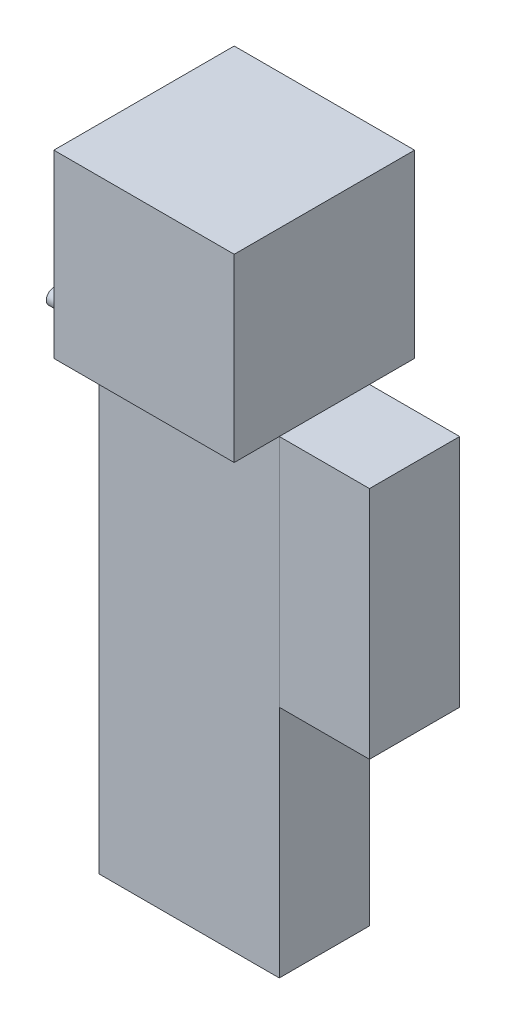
ISO-10303-21;
HEADER;
FILE_DESCRIPTION(('STEP AP214'),'2;1');
FILE_NAME('part.step','',(''),(''),'','','');
FILE_SCHEMA(('AUTOMOTIVE_DESIGN { 1 0 10303 214 1 1 1 1 }'));
ENDSEC;
DATA;
#1=APPLICATION_CONTEXT('core data for automotive mechanical design processes');
#2=APPLICATION_PROTOCOL_DEFINITION('international standard','automotive_design',2000,#1);
#3=PRODUCT_CONTEXT('',#1,'mechanical');
#4=PRODUCT('Part','Part','',(#3));
#5=PRODUCT_RELATED_PRODUCT_CATEGORY('part','',(#4));
#6=PRODUCT_DEFINITION_FORMATION('','',#4);
#7=PRODUCT_DEFINITION_CONTEXT('part definition',#1,'design');
#8=PRODUCT_DEFINITION('design','',#6,#7);
#9=PRODUCT_DEFINITION_SHAPE('','',#8);
#10=(LENGTH_UNIT() NAMED_UNIT(*) SI_UNIT(.MILLI.,.METRE.));
#11=(NAMED_UNIT(*) PLANE_ANGLE_UNIT() SI_UNIT($,.RADIAN.));
#12=(NAMED_UNIT(*) SI_UNIT($,.STERADIAN.) SOLID_ANGLE_UNIT());
#13=UNCERTAINTY_MEASURE_WITH_UNIT(LENGTH_MEASURE(1.E-05),#10,'distance_accuracy_value','');
#14=(GEOMETRIC_REPRESENTATION_CONTEXT(3) GLOBAL_UNCERTAINTY_ASSIGNED_CONTEXT((#13)) GLOBAL_UNIT_ASSIGNED_CONTEXT((#10,
#11,#12)) REPRESENTATION_CONTEXT('',''));
#15=CARTESIAN_POINT('',(0.,0.,0.));
#16=DIRECTION('',(0.,0.,1.));
#17=DIRECTION('',(1.,0.,0.));
#18=AXIS2_PLACEMENT_3D('',#15,#16,#17);
#19=CARTESIAN_POINT('',(-19.05,99.06,9.525));
#20=DIRECTION('',(0.,-1.,0.));
#21=DIRECTION('',(0.,0.,-1.));
#22=AXIS2_PLACEMENT_3D('',#19,#20,#21);
#23=PLANE('',#22);
#24=DIRECTION('',(1.,0.,0.));
#25=VECTOR('',#24,1.);
#26=CARTESIAN_POINT('',(-19.05,99.06,19.05));
#27=LINE('',#26,#25);
#28=CARTESIAN_POINT('',(-19.05,99.06,19.05));
#29=VERTEX_POINT('',#28);
#30=CARTESIAN_POINT('',(19.05,99.06,19.05));
#31=VERTEX_POINT('',#30);
#32=EDGE_CURVE('E98',#29,#31,#27,.T.);
#33=ORIENTED_EDGE('',*,*,#32,.F.);
#34=DIRECTION('',(0.,0.,1.));
#35=VECTOR('',#34,1.);
#36=CARTESIAN_POINT('',(-19.05,99.06,19.05));
#37=LINE('',#36,#35);
#38=CARTESIAN_POINT('',(-19.05,99.06,-19.05));
#39=VERTEX_POINT('',#38);
#40=EDGE_CURVE('E92',#39,#29,#37,.T.);
#41=ORIENTED_EDGE('',*,*,#40,.F.);
#42=DIRECTION('',(-1.,0.,0.));
#43=VECTOR('',#42,1.);
#44=CARTESIAN_POINT('',(-19.05,99.06,-19.05));
#45=LINE('',#44,#43);
#46=CARTESIAN_POINT('',(19.05,99.06,-19.05));
#47=VERTEX_POINT('',#46);
#48=EDGE_CURVE('E115',#47,#39,#45,.T.);
#49=ORIENTED_EDGE('',*,*,#48,.F.);
#50=DIRECTION('',(0.,0.,-1.));
#51=VECTOR('',#50,1.);
#52=CARTESIAN_POINT('',(19.05,99.06,19.05));
#53=LINE('',#52,#51);
#54=EDGE_CURVE('E123',#31,#47,#53,.T.);
#55=ORIENTED_EDGE('',*,*,#54,.F.);
#56=EDGE_LOOP('',(#33,#41,#49,#55));
#57=FACE_BOUND('',#56,.T.);
#58=ADVANCED_FACE('F58',(#57),#23,.T.);
#59=CARTESIAN_POINT('',(-19.05,137.16,-19.05));
#60=DIRECTION('',(0.,0.,1.));
#61=DIRECTION('',(1.,0.,0.));
#62=AXIS2_PLACEMENT_3D('',#59,#60,#61);
#63=PLANE('',#62);
#64=ORIENTED_EDGE('',*,*,#48,.T.);
#65=DIRECTION('',(0.,-1.,0.));
#66=VECTOR('',#65,1.);
#67=CARTESIAN_POINT('',(-19.05,137.16,-19.05));
#68=LINE('',#67,#66);
#69=CARTESIAN_POINT('',(-19.05,137.16,-19.05));
#70=VERTEX_POINT('',#69);
#71=EDGE_CURVE('E67',#70,#39,#68,.T.);
#72=ORIENTED_EDGE('',*,*,#71,.F.);
#73=DIRECTION('',(-1.,0.,0.));
#74=VECTOR('',#73,1.);
#75=CARTESIAN_POINT('',(-19.05,137.16,-19.05));
#76=LINE('',#75,#74);
#77=CARTESIAN_POINT('',(19.05,137.16,-19.05));
#78=VERTEX_POINT('',#77);
#79=EDGE_CURVE('E105',#78,#70,#76,.T.);
#80=ORIENTED_EDGE('',*,*,#79,.F.);
#81=DIRECTION('',(0.,-1.,0.));
#82=VECTOR('',#81,1.);
#83=CARTESIAN_POINT('',(19.05,137.16,-19.05));
#84=LINE('',#83,#82);
#85=EDGE_CURVE('E13',#78,#47,#84,.T.);
#86=ORIENTED_EDGE('',*,*,#85,.T.);
#87=EDGE_LOOP('',(#64,#72,#80,#86));
#88=FACE_BOUND('',#87,.T.);
#89=ADVANCED_FACE('F113',(#88),#63,.F.);
#90=CARTESIAN_POINT('',(-19.05,49.53,9.525));
#91=DIRECTION('',(1.,0.,0.));
#92=DIRECTION('',(0.,0.,-1.));
#93=AXIS2_PLACEMENT_3D('',#90,#91,#92);
#94=PLANE('',#93);
#95=ORIENTED_EDGE('',*,*,#40,.T.);
#96=DIRECTION('',(0.,-1.,0.));
#97=VECTOR('',#96,1.);
#98=CARTESIAN_POINT('',(-19.05,137.16,19.05));
#99=LINE('',#98,#97);
#100=CARTESIAN_POINT('',(-19.05,137.16,19.05));
#101=VERTEX_POINT('',#100);
#102=EDGE_CURVE('E116',#101,#29,#99,.T.);
#103=ORIENTED_EDGE('',*,*,#102,.F.);
#104=DIRECTION('',(0.,0.,1.));
#105=VECTOR('',#104,1.);
#106=CARTESIAN_POINT('',(-19.05,137.16,19.05));
#107=LINE('',#106,#105);
#108=EDGE_CURVE('E108',#70,#101,#107,.T.);
#109=ORIENTED_EDGE('',*,*,#108,.F.);
#110=ORIENTED_EDGE('',*,*,#71,.T.);
#111=EDGE_LOOP('',(#95,#103,#109,#110));
#112=FACE_BOUND('',#111,.T.);
#113=ADVANCED_FACE('F117',(#112),#94,.F.);
#114=CARTESIAN_POINT('',(0.,137.16,0.));
#115=DIRECTION('',(0.,-1.,0.));
#116=DIRECTION('',(0.,0.,-1.));
#117=AXIS2_PLACEMENT_3D('',#114,#115,#116);
#118=PLANE('',#117);
#119=DIRECTION('',(0.,0.,-1.));
#120=VECTOR('',#119,1.);
#121=CARTESIAN_POINT('',(19.05,137.16,19.05));
#122=LINE('',#121,#120);
#123=CARTESIAN_POINT('',(19.05,137.16,19.05));
#124=VERTEX_POINT('',#123);
#125=EDGE_CURVE('E110',#124,#78,#122,.T.);
#126=ORIENTED_EDGE('',*,*,#125,.T.);
#127=ORIENTED_EDGE('',*,*,#79,.T.);
#128=ORIENTED_EDGE('',*,*,#108,.T.);
#129=DIRECTION('',(1.,0.,0.));
#130=VECTOR('',#129,1.);
#131=CARTESIAN_POINT('',(-19.05,137.16,19.05));
#132=LINE('',#131,#130);
#133=EDGE_CURVE('E75',#101,#124,#132,.T.);
#134=ORIENTED_EDGE('',*,*,#133,.T.);
#135=EDGE_LOOP('',(#126,#127,#128,#134));
#136=FACE_BOUND('',#135,.T.);
#137=ADVANCED_FACE('F106',(#136),#118,.F.);
#138=CARTESIAN_POINT('',(19.05,49.53,9.525));
#139=DIRECTION('',(1.,0.,0.));
#140=DIRECTION('',(0.,0.,-1.));
#141=AXIS2_PLACEMENT_3D('',#138,#139,#140);
#142=PLANE('',#141);
#143=ORIENTED_EDGE('',*,*,#54,.T.);
#144=ORIENTED_EDGE('',*,*,#85,.F.);
#145=ORIENTED_EDGE('',*,*,#125,.F.);
#146=DIRECTION('',(0.,-1.,0.));
#147=VECTOR('',#146,1.);
#148=CARTESIAN_POINT('',(19.05,137.16,19.05));
#149=LINE('',#148,#147);
#150=EDGE_CURVE('E119',#124,#31,#149,.T.);
#151=ORIENTED_EDGE('',*,*,#150,.T.);
#152=EDGE_LOOP('',(#143,#144,#145,#151));
#153=FACE_BOUND('',#152,.T.);
#154=ADVANCED_FACE('F60',(#153),#142,.T.);
#155=CARTESIAN_POINT('',(-19.05,137.16,19.05));
#156=DIRECTION('',(0.,0.,-1.));
#157=DIRECTION('',(-1.,0.,0.));
#158=AXIS2_PLACEMENT_3D('',#155,#156,#157);
#159=PLANE('',#158);
#160=ORIENTED_EDGE('',*,*,#32,.T.);
#161=ORIENTED_EDGE('',*,*,#150,.F.);
#162=ORIENTED_EDGE('',*,*,#133,.F.);
#163=ORIENTED_EDGE('',*,*,#102,.T.);
#164=EDGE_LOOP('',(#160,#161,#162,#163));
#165=FACE_BOUND('',#164,.T.);
#166=ADVANCED_FACE('F129',(#165),#159,.F.);
#167=CLOSED_SHELL('',(#58,#89,#113,#137,#154,#166));
#168=MANIFOLD_SOLID_BREP('B2',#167);
#169=CARTESIAN_POINT('',(-19.05,99.06,9.525));
#170=DIRECTION('',(0.,-1.,0.));
#171=DIRECTION('',(0.,0.,-1.));
#172=AXIS2_PLACEMENT_3D('',#169,#170,#171);
#173=PLANE('',#172);
#174=DIRECTION('',(0.,0.,-1.));
#175=VECTOR('',#174,1.);
#176=CARTESIAN_POINT('',(19.05,99.06,9.525));
#177=LINE('',#176,#175);
#178=CARTESIAN_POINT('',(19.05,99.06,9.525));
#179=VERTEX_POINT('',#178);
#180=CARTESIAN_POINT('',(19.05,99.06,-9.525));
#181=VERTEX_POINT('',#180);
#182=EDGE_CURVE('E218',#179,#181,#177,.T.);
#183=ORIENTED_EDGE('',*,*,#182,.T.);
#184=DIRECTION('',(-1.,0.,0.));
#185=VECTOR('',#184,1.);
#186=CARTESIAN_POINT('',(-19.05,99.06,-9.525));
#187=LINE('',#186,#185);
#188=CARTESIAN_POINT('',(-19.05,99.06,-9.525));
#189=VERTEX_POINT('',#188);
#190=EDGE_CURVE('E223',#181,#189,#187,.T.);
#191=ORIENTED_EDGE('',*,*,#190,.T.);
#192=DIRECTION('',(0.,0.,-1.));
#193=VECTOR('',#192,1.);
#194=CARTESIAN_POINT('',(-19.05,99.06,9.525));
#195=LINE('',#194,#193);
#196=CARTESIAN_POINT('',(-19.05,99.06,9.525));
#197=VERTEX_POINT('',#196);
#198=EDGE_CURVE('E236',#197,#189,#195,.T.);
#199=ORIENTED_EDGE('',*,*,#198,.F.);
#200=DIRECTION('',(1.,0.,0.));
#201=VECTOR('',#200,1.);
#202=CARTESIAN_POINT('',(-19.05,99.06,9.525));
#203=LINE('',#202,#201);
#204=EDGE_CURVE('E56',#197,#179,#203,.T.);
#205=ORIENTED_EDGE('',*,*,#204,.T.);
#206=EDGE_LOOP('',(#183,#191,#199,#205));
#207=FACE_BOUND('',#206,.T.);
#208=ADVANCED_FACE('F215',(#207),#173,.F.);
#209=CARTESIAN_POINT('',(-38.1,91.44,0.));
#210=DIRECTION('',(-1.,0.,0.));
#211=DIRECTION('',(0.,0.,-1.));
#212=AXIS2_PLACEMENT_3D('',#209,#210,#211);
#213=PLANE('',#212);
#214=CARTESIAN_POINT('',(-38.1,91.44,0.));
#215=DIRECTION('',(1.,0.,0.));
#216=DIRECTION('',(0.,0.,-1.));
#217=AXIS2_PLACEMENT_3D('',#214,#215,#216);
#218=CIRCLE('',#217,1.5875);
#219=CARTESIAN_POINT('',(-38.1,91.44,-1.5875));
#220=VERTEX_POINT('',#219);
#221=EDGE_CURVE('E276',#220,#220,#218,.T.);
#222=ORIENTED_EDGE('',*,*,#221,.F.);
#223=EDGE_LOOP('',(#222));
#224=FACE_BOUND('',#223,.T.);
#225=ADVANCED_FACE('F303',(#224),#213,.T.);
#226=CARTESIAN_POINT('',(-38.1,91.44,0.));
#227=DIRECTION('',(1.,0.,0.));
#228=DIRECTION('',(0.,0.,-1.));
#229=AXIS2_PLACEMENT_3D('',#226,#227,#228);
#230=CYLINDRICAL_SURFACE('',#229,1.5875);
#231=CARTESIAN_POINT('',(-19.05,91.44,0.));
#232=DIRECTION('',(1.,0.,0.));
#233=DIRECTION('',(0.,0.,-1.));
#234=AXIS2_PLACEMENT_3D('',#231,#232,#233);
#235=CIRCLE('',#234,1.5875);
#236=CARTESIAN_POINT('',(-19.05,91.44,-1.5875));
#237=VERTEX_POINT('',#236);
#238=EDGE_CURVE('E279',#237,#237,#235,.T.);
#239=CARTESIAN_POINT('',(-38.1,91.44,-1.5875));
#240=CARTESIAN_POINT('',(-37.9015625,91.44,-1.5875));
#241=CARTESIAN_POINT('',(-37.703125,91.44,-1.5875));
#242=CARTESIAN_POINT('',(-37.30625,91.44,-1.5875));
#243=CARTESIAN_POINT('',(-37.1078125,91.44,-1.5875));
#244=CARTESIAN_POINT('',(-36.7109375,91.44,-1.5875));
#245=CARTESIAN_POINT('',(-36.5125,91.44,-1.5875));
#246=CARTESIAN_POINT('',(-36.115625,91.44,-1.5875));
#247=CARTESIAN_POINT('',(-35.9171875,91.44,-1.5875));
#248=CARTESIAN_POINT('',(-35.5203125,91.44,-1.5875));
#249=CARTESIAN_POINT('',(-35.321875,91.44,-1.5875));
#250=CARTESIAN_POINT('',(-34.925,91.44,-1.5875));
#251=CARTESIAN_POINT('',(-34.7265625,91.44,-1.5875));
#252=CARTESIAN_POINT('',(-34.3296875,91.44,-1.5875));
#253=CARTESIAN_POINT('',(-34.13125,91.44,-1.5875));
#254=CARTESIAN_POINT('',(-33.734375,91.44,-1.5875));
#255=CARTESIAN_POINT('',(-33.5359375,91.44,-1.5875));
#256=CARTESIAN_POINT('',(-33.1390625,91.44,-1.5875));
#257=CARTESIAN_POINT('',(-32.940625,91.44,-1.5875));
#258=CARTESIAN_POINT('',(-32.54375,91.44,-1.5875));
#259=CARTESIAN_POINT('',(-32.3453125,91.44,-1.5875));
#260=CARTESIAN_POINT('',(-31.9484375,91.44,-1.5875));
#261=CARTESIAN_POINT('',(-31.75,91.44,-1.5875));
#262=CARTESIAN_POINT('',(-31.353125,91.44,-1.5875));
#263=CARTESIAN_POINT('',(-31.1546875,91.44,-1.5875));
#264=CARTESIAN_POINT('',(-30.7578125,91.44,-1.5875));
#265=CARTESIAN_POINT('',(-30.559375,91.44,-1.5875));
#266=CARTESIAN_POINT('',(-30.1625,91.44,-1.5875));
#267=CARTESIAN_POINT('',(-29.9640625,91.44,-1.5875));
#268=CARTESIAN_POINT('',(-29.5671875,91.44,-1.5875));
#269=CARTESIAN_POINT('',(-29.36875,91.44,-1.5875));
#270=CARTESIAN_POINT('',(-28.971875,91.44,-1.5875));
#271=CARTESIAN_POINT('',(-28.7734375,91.44,-1.5875));
#272=CARTESIAN_POINT('',(-28.3765625,91.44,-1.5875));
#273=CARTESIAN_POINT('',(-28.178125,91.44,-1.5875));
#274=CARTESIAN_POINT('',(-27.78125,91.44,-1.5875));
#275=CARTESIAN_POINT('',(-27.5828125,91.44,-1.5875));
#276=CARTESIAN_POINT('',(-27.1859375,91.44,-1.5875));
#277=CARTESIAN_POINT('',(-26.9875,91.44,-1.5875));
#278=CARTESIAN_POINT('',(-26.590625,91.44,-1.5875));
#279=CARTESIAN_POINT('',(-26.3921875,91.44,-1.5875));
#280=CARTESIAN_POINT('',(-25.9953125,91.44,-1.5875));
#281=CARTESIAN_POINT('',(-25.796875,91.44,-1.5875));
#282=CARTESIAN_POINT('',(-25.4,91.44,-1.5875));
#283=CARTESIAN_POINT('',(-25.2015625,91.44,-1.5875));
#284=CARTESIAN_POINT('',(-24.8046875,91.44,-1.5875));
#285=CARTESIAN_POINT('',(-24.60625,91.44,-1.5875));
#286=CARTESIAN_POINT('',(-24.209375,91.44,-1.5875));
#287=CARTESIAN_POINT('',(-24.0109375,91.44,-1.5875));
#288=CARTESIAN_POINT('',(-23.6140625,91.44,-1.5875));
#289=CARTESIAN_POINT('',(-23.415625,91.44,-1.5875));
#290=CARTESIAN_POINT('',(-23.01875,91.44,-1.5875));
#291=CARTESIAN_POINT('',(-22.8203125,91.44,-1.5875));
#292=CARTESIAN_POINT('',(-22.4234375,91.44,-1.5875));
#293=CARTESIAN_POINT('',(-22.225,91.44,-1.5875));
#294=CARTESIAN_POINT('',(-21.828125,91.44,-1.5875));
#295=CARTESIAN_POINT('',(-21.6296875,91.44,-1.5875));
#296=CARTESIAN_POINT('',(-21.2328125,91.44,-1.5875));
#297=CARTESIAN_POINT('',(-21.034375,91.44,-1.5875));
#298=CARTESIAN_POINT('',(-20.6375,91.44,-1.5875));
#299=CARTESIAN_POINT('',(-20.4390625,91.44,-1.5875));
#300=CARTESIAN_POINT('',(-20.0421875,91.44,-1.5875));
#301=CARTESIAN_POINT('',(-19.84375,91.44,-1.5875));
#302=CARTESIAN_POINT('',(-19.446875,91.44,-1.5875));
#303=CARTESIAN_POINT('',(-19.2484375,91.44,-1.5875));
#304=CARTESIAN_POINT('',(-19.05,91.44,-1.5875));
#305=B_SPLINE_CURVE_WITH_KNOTS('',3,(#239,#240,#241,#242,#243,#244,#245,#246,#247,#248,#249,
#250,#251,#252,#253,#254,#255,#256,#257,#258,#259,#260,#261,#262,#263,#264,#265,#266,#267,#268,
#269,#270,#271,#272,#273,#274,#275,#276,#277,#278,#279,#280,#281,#282,#283,#284,#285,#286,#287,
#288,#289,#290,#291,#292,#293,#294,#295,#296,#297,#298,#299,#300,#301,#302,#303,#304),
.UNSPECIFIED.,.F.,.F.,(4,2,2,2,2,2,2,2,2,2,2,2,2,2,2,2,2,2,2,2,2,2,2,2,2,2,2,2,2,2,2,2,4),(0.,
0.5953125,1.190625,1.7859375,2.38125,2.9765625,3.571875,4.1671875,4.7625,5.3578125,5.953125,
6.5484375,7.14375,7.7390625,8.334375,8.9296875,9.525,10.1203125,10.715625,11.3109375,11.90625,
12.5015625,13.096875,13.6921875,14.2875,14.8828125,15.478125,16.0734375,16.66875,17.2640625,
17.859375,18.4546875,19.05),.UNSPECIFIED.);
#306=EDGE_CURVE('BSEAM309',#220,#237,#305,.T.);
#307=ORIENTED_EDGE('',*,*,#221,.T.);
#308=ORIENTED_EDGE('',*,*,#238,.F.);
#309=ORIENTED_EDGE('',*,*,#306,.T.);
#310=ORIENTED_EDGE('',*,*,#306,.F.);
#311=EDGE_LOOP('',(#307,#309,#308,#310));
#312=FACE_BOUND('',#311,.T.);
#313=ADVANCED_FACE('F309',(#312),#230,.T.);
#314=CARTESIAN_POINT('',(0.,0.,0.));
#315=DIRECTION('',(0.,-1.,0.));
#316=DIRECTION('',(0.,0.,-1.));
#317=AXIS2_PLACEMENT_3D('',#314,#315,#316);
#318=PLANE('',#317);
#319=DIRECTION('',(0.,0.,-1.));
#320=VECTOR('',#319,1.);
#321=CARTESIAN_POINT('',(19.05,0.,9.525));
#322=LINE('',#321,#320);
#323=CARTESIAN_POINT('',(19.05,0.,9.525));
#324=VERTEX_POINT('',#323);
#325=CARTESIAN_POINT('',(19.05,0.,-9.525));
#326=VERTEX_POINT('',#325);
#327=EDGE_CURVE('E262',#324,#326,#322,.T.);
#328=ORIENTED_EDGE('',*,*,#327,.F.);
#329=DIRECTION('',(1.,0.,0.));
#330=VECTOR('',#329,1.);
#331=CARTESIAN_POINT('',(-19.05,0.,9.525));
#332=LINE('',#331,#330);
#333=CARTESIAN_POINT('',(-19.05,0.,9.525));
#334=VERTEX_POINT('',#333);
#335=EDGE_CURVE('E264',#334,#324,#332,.T.);
#336=ORIENTED_EDGE('',*,*,#335,.F.);
#337=DIRECTION('',(0.,0.,1.));
#338=VECTOR('',#337,1.);
#339=CARTESIAN_POINT('',(-19.05,0.,9.525));
#340=LINE('',#339,#338);
#341=CARTESIAN_POINT('',(-19.05,0.,-9.525));
#342=VERTEX_POINT('',#341);
#343=EDGE_CURVE('E271',#342,#334,#340,.T.);
#344=ORIENTED_EDGE('',*,*,#343,.F.);
#345=DIRECTION('',(-1.,0.,0.));
#346=VECTOR('',#345,1.);
#347=CARTESIAN_POINT('',(-19.05,0.,-9.525));
#348=LINE('',#347,#346);
#349=EDGE_CURVE('E275',#326,#342,#348,.T.);
#350=ORIENTED_EDGE('',*,*,#349,.F.);
#351=EDGE_LOOP('',(#328,#336,#344,#350));
#352=FACE_BOUND('',#351,.T.);
#353=ADVANCED_FACE('F274',(#352),#318,.T.);
#354=CARTESIAN_POINT('',(-19.05,49.53,9.525));
#355=DIRECTION('',(1.,0.,0.));
#356=DIRECTION('',(0.,0.,-1.));
#357=AXIS2_PLACEMENT_3D('',#354,#355,#356);
#358=PLANE('',#357);
#359=ORIENTED_EDGE('',*,*,#238,.T.);
#360=EDGE_LOOP('',(#359));
#361=FACE_BOUND('',#360,.T.);
#362=DIRECTION('',(0.,-1.,0.));
#363=VECTOR('',#362,1.);
#364=CARTESIAN_POINT('',(-19.05,49.53,9.525));
#365=LINE('',#364,#363);
#366=EDGE_CURVE('E265',#197,#334,#365,.T.);
#367=ORIENTED_EDGE('',*,*,#366,.F.);
#368=ORIENTED_EDGE('',*,*,#198,.T.);
#369=DIRECTION('',(0.,-1.,0.));
#370=VECTOR('',#369,1.);
#371=CARTESIAN_POINT('',(-19.05,49.53,-9.525));
#372=LINE('',#371,#370);
#373=EDGE_CURVE('E290',#189,#342,#372,.T.);
#374=ORIENTED_EDGE('',*,*,#373,.T.);
#375=ORIENTED_EDGE('',*,*,#343,.T.);
#376=EDGE_LOOP('',(#367,#368,#374,#375));
#377=FACE_BOUND('',#376,.T.);
#378=ADVANCED_FACE('F294',(#361,#377),#358,.F.);
#379=CARTESIAN_POINT('',(19.05,49.53,9.525));
#380=DIRECTION('',(1.,0.,0.));
#381=DIRECTION('',(0.,0.,-1.));
#382=AXIS2_PLACEMENT_3D('',#379,#380,#381);
#383=PLANE('',#382);
#384=ORIENTED_EDGE('',*,*,#182,.F.);
#385=DIRECTION('',(0.,-1.,0.));
#386=VECTOR('',#385,1.);
#387=CARTESIAN_POINT('',(19.05,49.53,9.525));
#388=LINE('',#387,#386);
#389=EDGE_CURVE('E257',#179,#324,#388,.T.);
#390=ORIENTED_EDGE('',*,*,#389,.T.);
#391=ORIENTED_EDGE('',*,*,#327,.T.);
#392=DIRECTION('',(0.,-1.,0.));
#393=VECTOR('',#392,1.);
#394=CARTESIAN_POINT('',(19.05,49.53,-9.525));
#395=LINE('',#394,#393);
#396=EDGE_CURVE('E288',#181,#326,#395,.T.);
#397=ORIENTED_EDGE('',*,*,#396,.F.);
#398=EDGE_LOOP('',(#384,#390,#391,#397));
#399=FACE_BOUND('',#398,.T.);
#400=ADVANCED_FACE('F259',(#399),#383,.T.);
#401=CARTESIAN_POINT('',(-19.05,49.53,9.525));
#402=DIRECTION('',(0.,0.,-1.));
#403=DIRECTION('',(-1.,0.,0.));
#404=AXIS2_PLACEMENT_3D('',#401,#402,#403);
#405=PLANE('',#404);
#406=ORIENTED_EDGE('',*,*,#389,.F.);
#407=ORIENTED_EDGE('',*,*,#204,.F.);
#408=ORIENTED_EDGE('',*,*,#366,.T.);
#409=ORIENTED_EDGE('',*,*,#335,.T.);
#410=EDGE_LOOP('',(#406,#407,#408,#409));
#411=FACE_BOUND('',#410,.T.);
#412=ADVANCED_FACE('F268',(#411),#405,.F.);
#413=CARTESIAN_POINT('',(-19.05,49.53,-9.525));
#414=DIRECTION('',(0.,0.,1.));
#415=DIRECTION('',(1.,0.,0.));
#416=AXIS2_PLACEMENT_3D('',#413,#414,#415);
#417=PLANE('',#416);
#418=ORIENTED_EDGE('',*,*,#190,.F.);
#419=ORIENTED_EDGE('',*,*,#396,.T.);
#420=ORIENTED_EDGE('',*,*,#349,.T.);
#421=ORIENTED_EDGE('',*,*,#373,.F.);
#422=EDGE_LOOP('',(#418,#419,#420,#421));
#423=FACE_BOUND('',#422,.T.);
#424=ADVANCED_FACE('F295',(#423),#417,.F.);
#425=CLOSED_SHELL('',(#208,#225,#313,#353,#378,#400,#412,#424));
#426=MANIFOLD_SOLID_BREP('B7',#425);
#427=CARTESIAN_POINT('',(19.05,49.53,9.525));
#428=DIRECTION('',(1.,0.,0.));
#429=DIRECTION('',(0.,0.,-1.));
#430=AXIS2_PLACEMENT_3D('',#427,#428,#429);
#431=PLANE('',#430);
#432=DIRECTION('',(0.,0.,-1.));
#433=VECTOR('',#432,1.);
#434=CARTESIAN_POINT('',(19.05,49.53,0.));
#435=LINE('',#434,#433);
#436=CARTESIAN_POINT('',(19.05,49.53,9.525));
#437=VERTEX_POINT('',#436);
#438=CARTESIAN_POINT('',(19.05,49.53,-9.525));
#439=VERTEX_POINT('',#438);
#440=EDGE_CURVE('E464',#437,#439,#435,.T.);
#441=ORIENTED_EDGE('',*,*,#440,.F.);
#442=DIRECTION('',(0.,-1.,0.));
#443=VECTOR('',#442,1.);
#444=CARTESIAN_POINT('',(19.05,49.53,9.525));
#445=LINE('',#444,#443);
#446=CARTESIAN_POINT('',(19.05,99.06,9.525));
#447=VERTEX_POINT('',#446);
#448=EDGE_CURVE('E467',#447,#437,#445,.T.);
#449=ORIENTED_EDGE('',*,*,#448,.F.);
#450=DIRECTION('',(0.,0.,-1.));
#451=VECTOR('',#450,1.);
#452=CARTESIAN_POINT('',(19.05,99.06,0.));
#453=LINE('',#452,#451);
#454=CARTESIAN_POINT('',(19.05,99.06,-9.525));
#455=VERTEX_POINT('',#454);
#456=EDGE_CURVE('E213',#447,#455,#453,.T.);
#457=ORIENTED_EDGE('',*,*,#456,.T.);
#458=DIRECTION('',(0.,1.,0.));
#459=VECTOR('',#458,1.);
#460=CARTESIAN_POINT('',(19.05,49.53,-9.525));
#461=LINE('',#460,#459);
#462=EDGE_CURVE('E409',#439,#455,#461,.T.);
#463=ORIENTED_EDGE('',*,*,#462,.F.);
#464=EDGE_LOOP('',(#441,#449,#457,#463));
#465=FACE_BOUND('',#464,.T.);
#466=ADVANCED_FACE('F406',(#465),#431,.F.);
#467=CARTESIAN_POINT('',(-19.05,49.53,-9.525));
#468=DIRECTION('',(0.,0.,1.));
#469=DIRECTION('',(1.,0.,0.));
#470=AXIS2_PLACEMENT_3D('',#467,#468,#469);
#471=PLANE('',#470);
#472=DIRECTION('',(-1.,0.,0.));
#473=VECTOR('',#472,1.);
#474=CARTESIAN_POINT('',(38.1,49.53,-9.525));
#475=LINE('',#474,#473);
#476=CARTESIAN_POINT('',(38.1,49.53,-9.525));
#477=VERTEX_POINT('',#476);
#478=EDGE_CURVE('E451',#477,#439,#475,.T.);
#479=ORIENTED_EDGE('',*,*,#478,.T.);
#480=ORIENTED_EDGE('',*,*,#462,.T.);
#481=DIRECTION('',(-1.,0.,0.));
#482=VECTOR('',#481,1.);
#483=CARTESIAN_POINT('',(38.1,99.06,-9.525));
#484=LINE('',#483,#482);
#485=CARTESIAN_POINT('',(38.1,99.06,-9.525));
#486=VERTEX_POINT('',#485);
#487=EDGE_CURVE('E470',#486,#455,#484,.T.);
#488=ORIENTED_EDGE('',*,*,#487,.F.);
#489=DIRECTION('',(0.,1.,0.));
#490=VECTOR('',#489,1.);
#491=CARTESIAN_POINT('',(38.1,0.,-9.525));
#492=LINE('',#491,#490);
#493=EDGE_CURVE('E454',#477,#486,#492,.T.);
#494=ORIENTED_EDGE('',*,*,#493,.F.);
#495=EDGE_LOOP('',(#479,#480,#488,#494));
#496=FACE_BOUND('',#495,.T.);
#497=ADVANCED_FACE('F478',(#496),#471,.F.);
#498=CARTESIAN_POINT('',(38.1,91.44,0.));
#499=DIRECTION('',(1.,0.,0.));
#500=DIRECTION('',(0.,0.,-1.));
#501=AXIS2_PLACEMENT_3D('',#498,#499,#500);
#502=PLANE('',#501);
#503=DIRECTION('',(0.,-1.,0.));
#504=VECTOR('',#503,1.);
#505=CARTESIAN_POINT('',(38.1,0.,9.525));
#506=LINE('',#505,#504);
#507=CARTESIAN_POINT('',(38.1,99.06,9.525));
#508=VERTEX_POINT('',#507);
#509=CARTESIAN_POINT('',(38.1,49.53,9.525));
#510=VERTEX_POINT('',#509);
#511=EDGE_CURVE('E455',#508,#510,#506,.T.);
#512=ORIENTED_EDGE('',*,*,#511,.T.);
#513=DIRECTION('',(0.,0.,-1.));
#514=VECTOR('',#513,1.);
#515=CARTESIAN_POINT('',(38.1,49.53,0.));
#516=LINE('',#515,#514);
#517=EDGE_CURVE('E445',#510,#477,#516,.T.);
#518=ORIENTED_EDGE('',*,*,#517,.T.);
#519=ORIENTED_EDGE('',*,*,#493,.T.);
#520=DIRECTION('',(0.,0.,-1.));
#521=VECTOR('',#520,1.);
#522=CARTESIAN_POINT('',(38.1,99.06,0.));
#523=LINE('',#522,#521);
#524=EDGE_CURVE('E461',#508,#486,#523,.T.);
#525=ORIENTED_EDGE('',*,*,#524,.F.);
#526=EDGE_LOOP('',(#512,#518,#519,#525));
#527=FACE_BOUND('',#526,.T.);
#528=ADVANCED_FACE('F459',(#527),#502,.T.);
#529=CARTESIAN_POINT('',(-19.05,49.53,9.525));
#530=DIRECTION('',(0.,0.,-1.));
#531=DIRECTION('',(-1.,0.,0.));
#532=AXIS2_PLACEMENT_3D('',#529,#530,#531);
#533=PLANE('',#532);
#534=DIRECTION('',(-1.,0.,0.));
#535=VECTOR('',#534,1.);
#536=CARTESIAN_POINT('',(38.1,99.06,9.525));
#537=LINE('',#536,#535);
#538=EDGE_CURVE('E474',#508,#447,#537,.T.);
#539=ORIENTED_EDGE('',*,*,#538,.T.);
#540=ORIENTED_EDGE('',*,*,#448,.T.);
#541=DIRECTION('',(-1.,0.,0.));
#542=VECTOR('',#541,1.);
#543=CARTESIAN_POINT('',(38.1,49.53,9.525));
#544=LINE('',#543,#542);
#545=EDGE_CURVE('E450',#510,#437,#544,.T.);
#546=ORIENTED_EDGE('',*,*,#545,.F.);
#547=ORIENTED_EDGE('',*,*,#511,.F.);
#548=EDGE_LOOP('',(#539,#540,#546,#547));
#549=FACE_BOUND('',#548,.T.);
#550=ADVANCED_FACE('F466',(#549),#533,.F.);
#551=CARTESIAN_POINT('',(38.1,49.53,0.));
#552=DIRECTION('',(0.,1.,0.));
#553=DIRECTION('',(0.,0.,1.));
#554=AXIS2_PLACEMENT_3D('',#551,#552,#553);
#555=PLANE('',#554);
#556=ORIENTED_EDGE('',*,*,#440,.T.);
#557=ORIENTED_EDGE('',*,*,#478,.F.);
#558=ORIENTED_EDGE('',*,*,#517,.F.);
#559=ORIENTED_EDGE('',*,*,#545,.T.);
#560=EDGE_LOOP('',(#556,#557,#558,#559));
#561=FACE_BOUND('',#560,.T.);
#562=ADVANCED_FACE('F448',(#561),#555,.F.);
#563=CARTESIAN_POINT('',(38.1,99.06,0.));
#564=DIRECTION('',(0.,1.,0.));
#565=DIRECTION('',(0.,0.,1.));
#566=AXIS2_PLACEMENT_3D('',#563,#564,#565);
#567=PLANE('',#566);
#568=ORIENTED_EDGE('',*,*,#456,.F.);
#569=ORIENTED_EDGE('',*,*,#538,.F.);
#570=ORIENTED_EDGE('',*,*,#524,.T.);
#571=ORIENTED_EDGE('',*,*,#487,.T.);
#572=EDGE_LOOP('',(#568,#569,#570,#571));
#573=FACE_BOUND('',#572,.T.);
#574=ADVANCED_FACE('F479',(#573),#567,.T.);
#575=CLOSED_SHELL('',(#466,#497,#528,#550,#562,#574));
#576=MANIFOLD_SOLID_BREP('B50',#575);
#577=ADVANCED_BREP_SHAPE_REPRESENTATION('',(#18,#168,#426,#576),#14);
#578=SHAPE_DEFINITION_REPRESENTATION(#9,#577);
ENDSEC;
END-ISO-10303-21;
